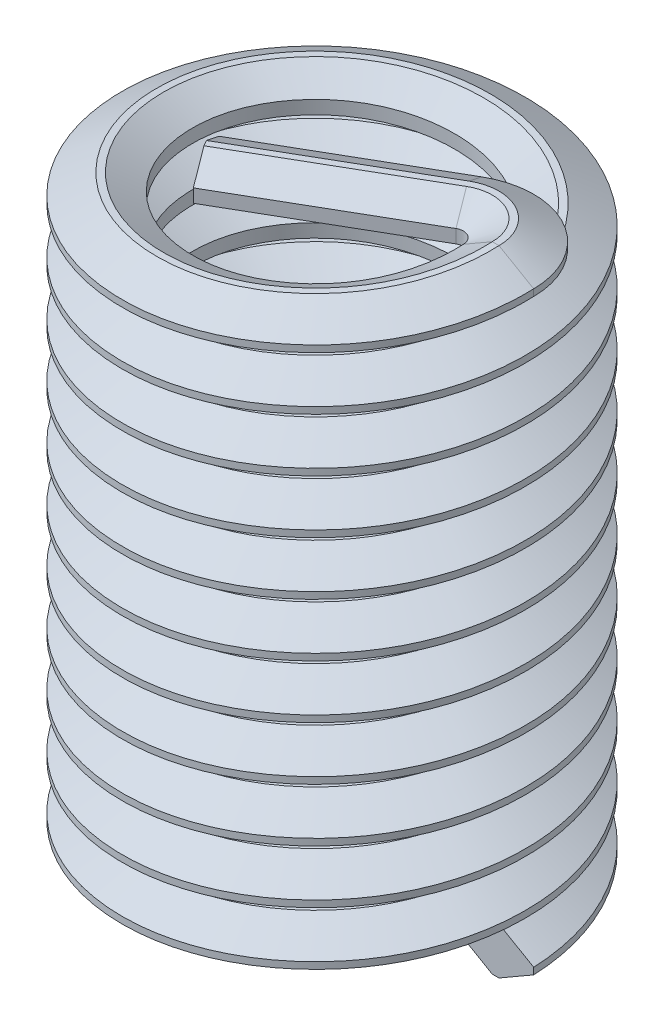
from build123d import *

# Parameters (mm, degrees)
SWEEP1_PITCH       = 1.5875
SWEEP1_HEIGHT      = 17.4625
SWEEP1_RADIUS      = 4.7625
SWEEP1_START_ANGLE = 90
REVOLVE1_ANGLE     = 120
EXTRUDE1_DEPTH     = 5.715


with BuildPart() as part:
    # Sweep1: sweep along a helix
    with BuildLine() as sweep1_path:
        add(Helix(SWEEP1_PITCH, SWEEP1_HEIGHT, SWEEP1_RADIUS, center=(0, 0, 0), direction=(0, 1, 0), mode=Mode.PRIVATE).rotate(Axis((0, 0, 0), (0, 1, 0)), SWEEP1_START_ANGLE))
    # Sketch1 → Sweep1 (sweep)
    with BuildSketch(Plane(origin=(0, 0, 0), x_dir=(-1, 0, 0), z_dir=(0, 0, 1))):
        Polygon((-5.9944, -0.09921875), (-4.963288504, -0.69453125), (-4.7625, -0.69453125), (-3.90324042, -0.1984375), (-3.90324042, 0.1984375), (-4.7625, 0.69453125), (-4.963288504, 0.69453125), (-5.9944, 0.09921875), align=None)
    sweep(path=sweep1_path.line, is_frenet=True)


with BuildPart() as body_2:
    # Sketch3 → Revolve1 (revolve)
    with BuildSketch(Plane(origin=(0, 0, 0), x_dir=(-1, 0, 0), z_dir=(0, 0, -1))):
        Polygon((-4.7625, 16.76796875), (-3.90324042, 17.2640625), (-3.90324042, 17.6609375), (-4.7625, 18.15703125), (-4.963288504, 18.15703125), (-5.9944, 17.56171875), (-5.9944, 17.36328125), (-4.963288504, 16.76796875), align=None)
    revolve(axis=Axis((3.559536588, 17.4625, 0), (0, 1, 0)), revolution_arc=REVOLVE1_ANGLE)

    # Sketch4 → Extrude1 (add)
    with BuildSketch(Plane(origin=(2.669652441, 0, -1.541324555), x_dir=(0.500000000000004, 0, 0.8660254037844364), z_dir=(-0.8660254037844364, 1.182924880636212e-15, 0.500000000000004))):
        Polygon((0.376016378, 16.76796875), (0.576804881, 16.76796875), (1.436064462, 17.2640625), (1.436064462, 17.6609375), (0.576804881, 18.15703125), (0.376016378, 18.15703125), (-0.655095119, 17.56171875), (-0.655095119, 17.36328125), align=None)
    extrude(amount=EXTRUDE1_DEPTH)


solid = Compound([part.part, body_2.part])
